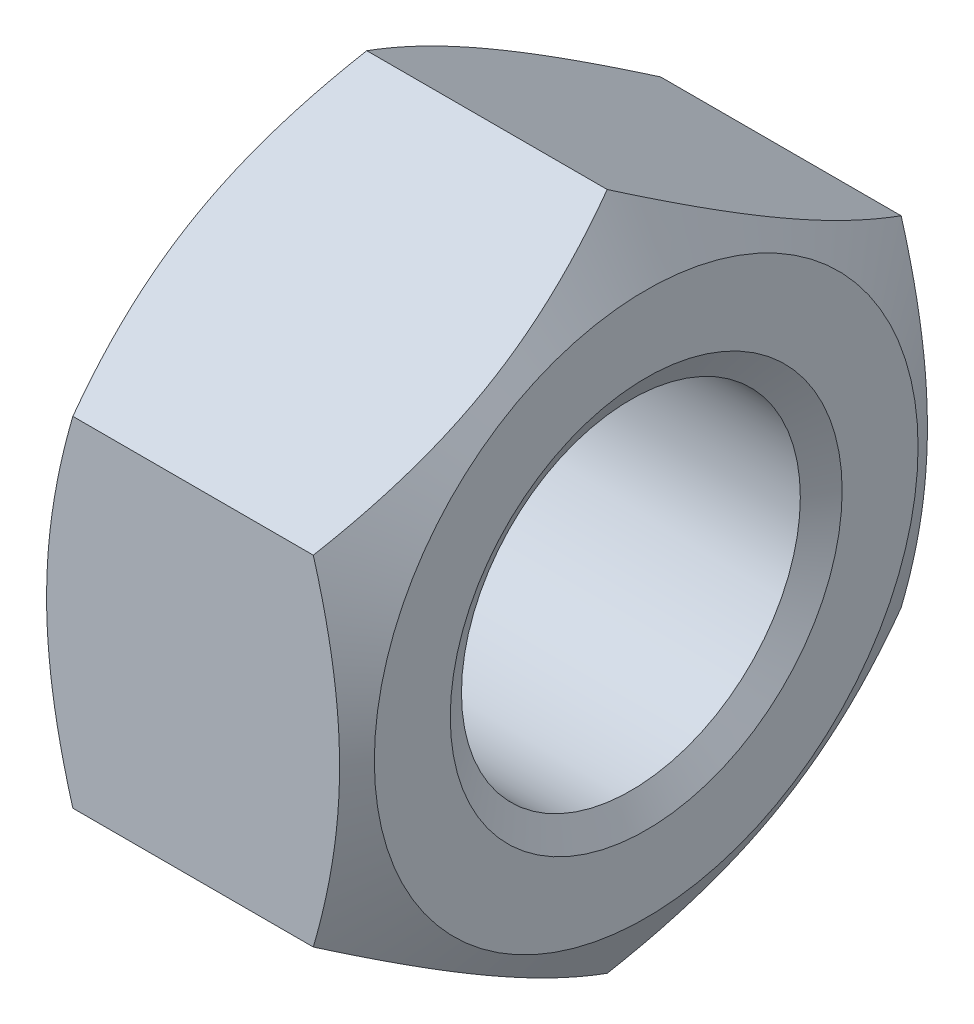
ISO-10303-21;
HEADER;
FILE_DESCRIPTION(('STEP AP214'),'2;1');
FILE_NAME('part.step','',(''),(''),'','','');
FILE_SCHEMA(('AUTOMOTIVE_DESIGN { 1 0 10303 214 1 1 1 1 }'));
ENDSEC;
DATA;
#1=APPLICATION_CONTEXT('core data for automotive mechanical design processes');
#2=APPLICATION_PROTOCOL_DEFINITION('international standard','automotive_design',2000,#1);
#3=PRODUCT_CONTEXT('',#1,'mechanical');
#4=PRODUCT('Part','Part','',(#3));
#5=PRODUCT_RELATED_PRODUCT_CATEGORY('part','',(#4));
#6=PRODUCT_DEFINITION_FORMATION('','',#4);
#7=PRODUCT_DEFINITION_CONTEXT('part definition',#1,'design');
#8=PRODUCT_DEFINITION('design','',#6,#7);
#9=PRODUCT_DEFINITION_SHAPE('','',#8);
#10=(LENGTH_UNIT() NAMED_UNIT(*) SI_UNIT(.MILLI.,.METRE.));
#11=(NAMED_UNIT(*) PLANE_ANGLE_UNIT() SI_UNIT($,.RADIAN.));
#12=(NAMED_UNIT(*) SI_UNIT($,.STERADIAN.) SOLID_ANGLE_UNIT());
#13=UNCERTAINTY_MEASURE_WITH_UNIT(LENGTH_MEASURE(1.E-05),#10,'distance_accuracy_value','');
#14=(GEOMETRIC_REPRESENTATION_CONTEXT(3) GLOBAL_UNCERTAINTY_ASSIGNED_CONTEXT((#13)) GLOBAL_UNIT_ASSIGNED_CONTEXT((#10,
#11,#12)) REPRESENTATION_CONTEXT('',''));
#15=CARTESIAN_POINT('',(0.,0.,0.));
#16=DIRECTION('',(0.,0.,1.));
#17=DIRECTION('',(1.,0.,0.));
#18=AXIS2_PLACEMENT_3D('',#15,#16,#17);
#19=CARTESIAN_POINT('',(0.,-6.92820323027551,12.));
#20=DIRECTION('',(0.,0.,1.));
#21=DIRECTION('',(1.,0.,0.));
#22=AXIS2_PLACEMENT_3D('',#19,#20,#21);
#23=PLANE('',#22);
#24=CARTESIAN_POINT('',(11.4085879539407,6.92820325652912,11.9999999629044));
#25=CARTESIAN_POINT('',(11.496499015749,6.62361160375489,11.9999999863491));
#26=CARTESIAN_POINT('',(11.580419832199,6.31788427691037,11.9999999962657));
#27=CARTESIAN_POINT('',(11.7391738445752,5.70397794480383,12.0000000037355));
#28=CARTESIAN_POINT('',(11.8140040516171,5.39579816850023,12.0000000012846));
#29=CARTESIAN_POINT('',(12.0234105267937,4.4662933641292,11.9999999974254));
#30=CARTESIAN_POINT('',(12.1425185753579,3.8412990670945,11.9999999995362));
#31=CARTESIAN_POINT('',(12.2821814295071,2.90602380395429,12.0000000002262));
#32=CARTESIAN_POINT('',(12.3219656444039,2.59853682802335,12.0000000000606));
#33=CARTESIAN_POINT('',(12.3886800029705,1.98213930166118,11.9999999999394));
#34=CARTESIAN_POINT('',(12.4156098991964,1.67322872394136,11.9999999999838));
#35=CARTESIAN_POINT('',(12.4559258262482,1.05489265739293,12.0000000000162));
#36=CARTESIAN_POINT('',(12.4693279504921,0.745468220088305,12.0000000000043));
#37=CARTESIAN_POINT('',(12.4823027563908,0.126332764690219,11.9999999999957));
#38=CARTESIAN_POINT('',(12.4818758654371,-0.183378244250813,11.9999999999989));
#39=CARTESIAN_POINT('',(12.4681585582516,-0.762368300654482,12.0000000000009));
#40=CARTESIAN_POINT('',(12.4565413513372,-1.03168866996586,12.0000000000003));
#41=CARTESIAN_POINT('',(12.423068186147,-1.56970995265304,11.9999999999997));
#42=CARTESIAN_POINT('',(12.4012115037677,-1.838410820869,11.9999999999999));
#43=CARTESIAN_POINT('',(12.3476403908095,-2.37504708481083,12.0000000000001));
#44=CARTESIAN_POINT('',(12.3159178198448,-2.64298166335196,12.));
#45=CARTESIAN_POINT('',(12.2431714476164,-3.17759475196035,12.));
#46=CARTESIAN_POINT('',(12.202147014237,-3.44427317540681,12.));
#47=CARTESIAN_POINT('',(12.0640839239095,-4.25378962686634,12.));
#48=CARTESIAN_POINT('',(11.9532796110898,-4.79428356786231,12.));
#49=CARTESIAN_POINT('',(11.7017999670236,-5.8672125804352,12.));
#50=CARTESIAN_POINT('',(11.5611836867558,-6.39966138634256,12.));
#51=CARTESIAN_POINT('',(11.4085880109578,-6.92820314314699,12.));
#52=B_SPLINE_CURVE_WITH_KNOTS('',3,(#24,#25,#26,#27,#28,#29,#30,#31,#32,#33,#34,#35,#36,#37,#38,
#39,#40,#41,#42,#43,#44,#45,#46,#47,#48,#49,#50,#51),.UNSPECIFIED.,.F.,.F.,(4,2,2,2,2,2,2,2,2,2,
2,2,2,4),(0.,0.950996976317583,1.90230578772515,3.80897262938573,4.73890633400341,
5.66885793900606,6.59770191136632,7.52651717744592,8.33503485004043,9.14360970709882,
9.95285350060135,10.7621523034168,12.4163368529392,14.0672749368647),.UNSPECIFIED.);
#53=CARTESIAN_POINT('',(11.4085879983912,6.92820325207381,11.9999999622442));
#54=VERTEX_POINT('',#53);
#55=CARTESIAN_POINT('',(11.4085879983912,-6.92820318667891,12.));
#56=VERTEX_POINT('',#55);
#57=EDGE_CURVE('E91',#54,#56,#52,.T.);
#58=ORIENTED_EDGE('',*,*,#57,.F.);
#59=DIRECTION('',(1.,0.,0.));
#60=VECTOR('',#59,1.);
#61=CARTESIAN_POINT('',(0.,6.92820323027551,12.));
#62=LINE('',#61,#60);
#63=CARTESIAN_POINT('',(1.59141200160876,6.92820318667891,12.));
#64=VERTEX_POINT('',#63);
#65=EDGE_CURVE('E79',#64,#54,#62,.T.);
#66=ORIENTED_EDGE('',*,*,#65,.F.);
#67=CARTESIAN_POINT('',(1.59141198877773,-6.92820314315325,12.0000000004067));
#68=CARTESIAN_POINT('',(1.50350094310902,-6.62361148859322,12.0000000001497));
#69=CARTESIAN_POINT('',(1.41958013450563,-6.31788416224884,12.0000000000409));
#70=CARTESIAN_POINT('',(1.26082613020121,-5.70397783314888,11.999999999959));
#71=CARTESIAN_POINT('',(1.18599592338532,-5.39579805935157,11.9999999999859));
#72=CARTESIAN_POINT('',(0.976589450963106,-4.46629326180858,12.0000000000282));
#73=CARTESIAN_POINT('',(0.857481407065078,-3.84129896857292,12.0000000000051));
#74=CARTESIAN_POINT('',(0.717818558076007,-2.90602371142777,11.9999999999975));
#75=CARTESIAN_POINT('',(0.67803434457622,-2.59853673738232,11.9999999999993));
#76=CARTESIAN_POINT('',(0.611319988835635,-1.98213921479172,12.0000000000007));
#77=CARTESIAN_POINT('',(0.58439009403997,-1.67322863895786,12.0000000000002));
#78=CARTESIAN_POINT('',(0.544074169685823,-1.05489257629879,11.9999999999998));
#79=CARTESIAN_POINT('',(0.530672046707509,-0.745468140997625,12.));
#80=CARTESIAN_POINT('',(0.517697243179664,-0.126332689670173,12.));
#81=CARTESIAN_POINT('',(0.518124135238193,0.18337831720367,12.));
#82=CARTESIAN_POINT('',(0.531841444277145,0.762368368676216,12.));
#83=CARTESIAN_POINT('',(0.543458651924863,1.03168873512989,12.));
#84=CARTESIAN_POINT('',(0.576931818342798,1.56971001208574,12.));
#85=CARTESIAN_POINT('',(0.598788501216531,1.83841087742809,12.));
#86=CARTESIAN_POINT('',(0.652359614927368,2.37504713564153,12.));
#87=CARTESIAN_POINT('',(0.684082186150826,2.64298171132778,12.));
#88=CARTESIAN_POINT('',(0.756828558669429,3.1775947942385,12.));
#89=CARTESIAN_POINT('',(0.797852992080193,3.44427321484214,12.));
#90=CARTESIAN_POINT('',(0.93591608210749,4.25378965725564,12.));
#91=CARTESIAN_POINT('',(1.04672039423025,4.79428359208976,12.));
#92=CARTESIAN_POINT('',(1.29820003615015,5.86721259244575,12.));
#93=CARTESIAN_POINT('',(1.43881631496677,6.39966139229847,12.));
#94=CARTESIAN_POINT('',(1.59141198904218,6.92820314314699,12.));
#95=B_SPLINE_CURVE_WITH_KNOTS('',3,(#67,#68,#69,#70,#71,#72,#73,#74,#75,#76,#77,#78,#79,#80,#81,
#82,#83,#84,#85,#86,#87,#88,#89,#90,#91,#92,#93,#94),.UNSPECIFIED.,.F.,.F.,(4,2,2,2,2,2,2,2,2,2,
2,2,2,4),(0.,0.950996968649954,1.90230577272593,3.80897260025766,4.73890629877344,
5.6688578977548,6.59770186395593,7.52651712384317,8.33503478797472,9.14360963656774,
9.95285342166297,10.7621522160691,12.4163367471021,14.0672748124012),.UNSPECIFIED.);
#96=CARTESIAN_POINT('',(1.5914120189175,-6.92820322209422,12.0000000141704));
#97=VERTEX_POINT('',#96);
#98=EDGE_CURVE('E115',#97,#64,#95,.T.);
#99=ORIENTED_EDGE('',*,*,#98,.F.);
#100=DIRECTION('',(1.,0.,0.));
#101=VECTOR('',#100,1.);
#102=CARTESIAN_POINT('',(0.,-6.92820323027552,12.));
#103=LINE('',#102,#101);
#104=EDGE_CURVE('E94',#56,#97,#103,.F.);
#105=ORIENTED_EDGE('',*,*,#104,.F.);
#106=EDGE_LOOP('',(#58,#66,#99,#105));
#107=FACE_BOUND('',#106,.T.);
#108=ADVANCED_FACE('F15',(#107),#23,.T.);
#109=CARTESIAN_POINT('',(0.,6.92820323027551,12.));
#110=DIRECTION('',(0.,0.866025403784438,0.500000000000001));
#111=DIRECTION('',(0.,-0.500000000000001,0.866025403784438));
#112=AXIS2_PLACEMENT_3D('',#109,#110,#111);
#113=PLANE('',#112);
#114=CARTESIAN_POINT('',(11.4085880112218,13.8564064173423,7.56524396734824E-08));
#115=CARTESIAN_POINT('',(11.4964990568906,13.7041105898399,0.263784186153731));
#116=CARTESIAN_POINT('',(11.5804198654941,13.5512469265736,0.528551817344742));
#117=CARTESIAN_POINT('',(11.7391738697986,13.2442937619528,1.06021029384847));
#118=CARTESIAN_POINT('',(11.8140040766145,13.0902038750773,1.32710180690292));
#119=CARTESIAN_POINT('',(12.0234105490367,12.6254514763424,2.13207657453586));
#120=CARTESIAN_POINT('',(12.1425185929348,12.3129543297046,2.6733375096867));
#121=CARTESIAN_POINT('',(12.2821814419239,11.8453167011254,3.48330964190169));
#122=CARTESIAN_POINT('',(12.3219656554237,11.6915732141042,3.74960117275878));
#123=CARTESIAN_POINT('',(12.3886800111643,11.3833744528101,4.28341708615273));
#124=CARTESIAN_POINT('',(12.41560990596,11.2289191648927,4.5509414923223));
#125=CARTESIAN_POINT('',(12.4559258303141,10.9197511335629,5.08643623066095));
#126=CARTESIAN_POINT('',(12.4693279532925,10.7650389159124,5.3544056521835));
#127=CARTESIAN_POINT('',(12.4823027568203,10.4554711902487,5.89059268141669));
#128=CARTESIAN_POINT('',(12.4818758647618,10.3006156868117,6.15881028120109));
#129=CARTESIAN_POINT('',(12.4681585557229,10.0111206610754,6.66023037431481));
#130=CARTESIAN_POINT('',(12.4565413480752,9.8764604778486,6.89346865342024));
#131=CARTESIAN_POINT('',(12.4230681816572,9.60744983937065,7.3594087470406));
#132=CARTESIAN_POINT('',(12.4012114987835,9.47309940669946,7.59211052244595));
#133=CARTESIAN_POINT('',(12.3476403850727,9.20478127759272,8.05685115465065));
#134=CARTESIAN_POINT('',(12.3159178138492,9.07081398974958,8.28888930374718));
#135=CARTESIAN_POINT('',(12.2431714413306,8.8035074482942,8.75187781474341));
#136=CARTESIAN_POINT('',(12.2021470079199,8.67016823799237,8.98282810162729));
#137=CARTESIAN_POINT('',(12.0640839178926,8.26541001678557,9.68388990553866));
#138=CARTESIAN_POINT('',(11.9532796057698,7.99516304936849,10.1519713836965));
#139=CARTESIAN_POINT('',(11.7017999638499,7.45869854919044,11.0811551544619));
#140=CARTESIAN_POINT('',(11.5611836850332,7.19247414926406,11.5422693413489));
#141=CARTESIAN_POINT('',(11.4085880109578,6.92820327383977,11.9999999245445));
#142=B_SPLINE_CURVE_WITH_KNOTS('',3,(#114,#115,#116,#117,#118,#119,#120,#121,#122,#123,#124,
#125,#126,#127,#128,#129,#130,#131,#132,#133,#134,#135,#136,#137,#138,#139,#140,#141),
.UNSPECIFIED.,.F.,.F.,(4,2,2,2,2,2,2,2,2,2,2,2,2,4),(0.,0.950996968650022,1.90230577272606,
3.80897260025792,4.73890629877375,5.66885789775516,6.59770186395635,7.52651712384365,
8.33503478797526,9.14360963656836,9.95285342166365,10.7621522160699,12.416336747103,
14.0672748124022),.UNSPECIFIED.);
#143=CARTESIAN_POINT('',(11.4085879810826,13.8564064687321,1.4169979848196E-08));
#144=VERTEX_POINT('',#143);
#145=EDGE_CURVE('E19',#144,#54,#142,.T.);
#146=ORIENTED_EDGE('',*,*,#145,.F.);
#147=DIRECTION('',(1.,0.,0.));
#148=VECTOR('',#147,1.);
#149=CARTESIAN_POINT('',(0.,13.856406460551,0.));
#150=LINE('',#149,#148);
#151=CARTESIAN_POINT('',(1.59141200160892,13.856406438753,3.77553228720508E-08));
#152=VERTEX_POINT('',#151);
#153=EDGE_CURVE('E72',#152,#144,#150,.T.);
#154=ORIENTED_EDGE('',*,*,#153,.F.);
#155=CARTESIAN_POINT('',(1.59141204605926,6.92820318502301,12.0000000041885));
#156=CARTESIAN_POINT('',(1.50350098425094,7.08049903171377,11.7362159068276));
#157=CARTESIAN_POINT('',(1.41958016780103,7.23336270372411,11.4714482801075));
#158=CARTESIAN_POINT('',(1.26082615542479,7.54031587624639,10.939789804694));
#159=CARTESIAN_POINT('',(1.18599594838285,7.69440576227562,10.672898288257));
#160=CARTESIAN_POINT('',(0.976589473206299,8.15915816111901,9.86792351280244));
#161=CARTESIAN_POINT('',(0.857481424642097,8.47165531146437,9.3266625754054));
#162=CARTESIAN_POINT('',(0.717818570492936,8.93929294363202,8.51669043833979));
#163=CARTESIAN_POINT('',(0.67803435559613,9.09303643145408,8.25039890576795));
#164=CARTESIAN_POINT('',(0.611319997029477,9.40123519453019,7.71658298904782));
#165=CARTESIAN_POINT('',(0.584390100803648,9.55569048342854,7.44905858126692));
#166=CARTESIAN_POINT('',(0.544074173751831,9.86485851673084,6.91356383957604));
#167=CARTESIAN_POINT('',(0.530672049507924,10.0195707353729,6.64559441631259));
#168=CARTESIAN_POINT('',(0.517697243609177,10.3291384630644,6.10940738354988));
#169=CARTESIAN_POINT('',(0.51812413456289,10.4839939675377,5.84118978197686));
#170=CARTESIAN_POINT('',(0.531841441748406,10.7734889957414,5.33976968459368));
#171=CARTESIAN_POINT('',(0.543458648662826,10.9081491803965,5.10653140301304));
#172=CARTESIAN_POINT('',(0.57693181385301,11.1771598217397,4.64059130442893));
#173=CARTESIAN_POINT('',(0.59878849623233,11.3115102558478,4.40788952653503));
#174=CARTESIAN_POINT('',(0.652359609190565,11.5798283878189,3.94314888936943));
#175=CARTESIAN_POINT('',(0.68408218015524,11.7137956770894,3.71111073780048));
#176=CARTESIAN_POINT('',(0.756828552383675,11.9811022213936,3.24812222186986));
#177=CARTESIAN_POINT('',(0.797852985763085,12.1144414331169,3.01717193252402));
#178=CARTESIAN_POINT('',(0.93591607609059,12.5191996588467,2.31611012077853));
#179=CARTESIAN_POINT('',(1.04672038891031,12.7894466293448,1.84802863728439));
#180=CARTESIAN_POINT('',(1.29820003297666,13.3259111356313,0.918844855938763));
#181=CARTESIAN_POINT('',(1.43881631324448,13.592135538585,0.457730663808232));
#182=CARTESIAN_POINT('',(1.59141198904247,13.8564064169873,7.54546713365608E-08));
#183=B_SPLINE_CURVE_WITH_KNOTS('',3,(#155,#156,#157,#158,#159,#160,#161,#162,#163,#164,#165,
#166,#167,#168,#169,#170,#171,#172,#173,#174,#175,#176,#177,#178,#179,#180,#181,#182),
.UNSPECIFIED.,.F.,.F.,(4,2,2,2,2,2,2,2,2,2,2,2,2,4),(0.,0.950996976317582,1.90230578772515,
3.80897262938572,4.7389063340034,5.66885793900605,6.59770191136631,7.52651717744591,
8.33503485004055,9.14360970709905,9.95285350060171,10.7621523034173,12.4163368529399,
14.0672749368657),.UNSPECIFIED.);
#184=EDGE_CURVE('E82',#64,#152,#183,.T.);
#185=ORIENTED_EDGE('',*,*,#184,.F.);
#186=ORIENTED_EDGE('',*,*,#65,.T.);
#187=EDGE_LOOP('',(#146,#154,#185,#186));
#188=FACE_BOUND('',#187,.T.);
#189=ADVANCED_FACE('F81',(#188),#113,.T.);
#190=CARTESIAN_POINT('',(0.,13.856406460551,0.));
#191=DIRECTION('',(0.,0.866025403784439,-0.499999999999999));
#192=DIRECTION('',(0.,0.499999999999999,0.866025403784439));
#193=AXIS2_PLACEMENT_3D('',#190,#191,#192);
#194=PLANE('',#193);
#195=CARTESIAN_POINT('',(11.4085879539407,6.92820318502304,-12.0000000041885));
#196=CARTESIAN_POINT('',(11.4964990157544,7.08049903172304,-11.7362159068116));
#197=CARTESIAN_POINT('',(11.5804198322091,7.23336270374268,-11.4714482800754));
#198=CARTESIAN_POINT('',(11.7391738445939,7.54031587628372,-10.9397898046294));
#199=CARTESIAN_POINT('',(11.8140040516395,7.69440576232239,-10.672898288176));
#200=CARTESIAN_POINT('',(12.0234105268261,8.15915816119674,-9.86792351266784));
#201=CARTESIAN_POINT('',(12.1425185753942,8.47165531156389,-9.32666257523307));
#202=CARTESIAN_POINT('',(12.2821814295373,8.93929294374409,-8.51669043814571));
#203=CARTESIAN_POINT('',(12.3219656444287,9.09303643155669,-8.25039890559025));
#204=CARTESIAN_POINT('',(12.388680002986,9.40123519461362,-7.71658298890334));
#205=CARTESIAN_POINT('',(12.4156098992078,9.55569048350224,-7.44905858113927));
#206=CARTESIAN_POINT('',(12.4559258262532,9.86485851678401,-6.91356383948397));
#207=CARTESIAN_POINT('',(12.4693279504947,10.0195707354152,-6.64559441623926));
#208=CARTESIAN_POINT('',(12.4823027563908,10.3291384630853,-6.10940738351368));
#209=CARTESIAN_POINT('',(12.4818758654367,10.483993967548,-5.84118978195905));
#210=CARTESIAN_POINT('',(12.4681585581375,10.7734889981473,-5.33976968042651));
#211=CARTESIAN_POINT('',(12.4565413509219,10.9081491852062,-5.10653139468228));
#212=CARTESIAN_POINT('',(12.4230681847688,11.1771598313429,-4.64059128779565));
#213=CARTESIAN_POINT('',(12.4012115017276,11.3115102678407,-4.40788950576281));
#214=CARTESIAN_POINT('',(12.3476403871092,11.5798284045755,-3.94314886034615));
#215=CARTESIAN_POINT('',(12.3159178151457,11.7137956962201,-3.71111070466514));
#216=CARTESIAN_POINT('',(12.2431714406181,11.9811022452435,-3.24812218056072));
#217=CARTESIAN_POINT('',(12.2021470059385,12.1144414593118,-3.01717188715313));
#218=CARTESIAN_POINT('',(12.0640839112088,12.5191996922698,-2.31611006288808));
#219=CARTESIAN_POINT('',(11.9532795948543,12.789446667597,-1.84802857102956));
#220=CARTESIAN_POINT('',(11.7017999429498,13.3259111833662,-0.918844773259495));
#221=CARTESIAN_POINT('',(11.5611836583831,13.592135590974,-0.457730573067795));
#222=CARTESIAN_POINT('',(11.4085879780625,13.8564064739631,2.323042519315E-08));
#223=B_SPLINE_CURVE_WITH_KNOTS('',3,(#195,#196,#197,#198,#199,#200,#201,#202,#203,#204,#205,
#206,#207,#208,#209,#210,#211,#212,#213,#214,#215,#216,#217,#218,#219,#220,#221,#222),
.UNSPECIFIED.,.F.,.F.,(4,2,2,2,2,2,2,2,2,2,2,2,2,4),(0.,0.950996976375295,1.90230578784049,
3.80897262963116,4.7389063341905,5.66885793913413,6.59770191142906,7.52651717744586,
8.33503486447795,9.14360973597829,9.95285354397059,10.7621523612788,12.4163369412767,
14.0672750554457),.UNSPECIFIED.);
#224=CARTESIAN_POINT('',(11.4085879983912,6.92820318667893,-12.));
#225=VERTEX_POINT('',#224);
#226=EDGE_CURVE('E93',#225,#144,#223,.T.);
#227=ORIENTED_EDGE('',*,*,#226,.F.);
#228=DIRECTION('',(-1.,0.,0.));
#229=VECTOR('',#228,1.);
#230=CARTESIAN_POINT('',(0.,6.92820323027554,-12.));
#231=LINE('',#230,#229);
#232=CARTESIAN_POINT('',(1.59141200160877,6.92820325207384,-11.9999999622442));
#233=VERTEX_POINT('',#232);
#234=EDGE_CURVE('E188',#233,#225,#231,.F.);
#235=ORIENTED_EDGE('',*,*,#234,.F.);
#236=CARTESIAN_POINT('',(1.59141204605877,13.8564064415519,4.12830518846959E-08));
#237=CARTESIAN_POINT('',(1.50350098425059,13.7041106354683,-0.263784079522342));
#238=CARTESIAN_POINT('',(1.41958016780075,13.551246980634,-0.528551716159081));
#239=CARTESIAN_POINT('',(1.26082615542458,13.2442938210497,-1.06021019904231));
#240=CARTESIAN_POINT('',(1.18599594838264,13.0902039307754,-1.32710171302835));
#241=CARTESIAN_POINT('',(0.976589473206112,12.6254515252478,-2.13207648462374));
#242=CARTESIAN_POINT('',(0.857481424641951,12.3129543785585,-2.67333742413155));
#243=CARTESIAN_POINT('',(0.717818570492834,11.8453167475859,-3.48330956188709));
#244=CARTESIAN_POINT('',(0.67803435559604,11.691573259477,-3.74960109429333));
#245=CARTESIAN_POINT('',(0.61131999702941,11.383374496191,-4.28341701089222));
#246=CARTESIAN_POINT('',(0.584390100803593,11.2289192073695,-4.55094141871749));
#247=CARTESIAN_POINT('',(0.544074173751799,10.9197511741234,-5.08643616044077));
#248=CARTESIAN_POINT('',(0.530672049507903,10.7650389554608,-5.35440558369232));
#249=CARTESIAN_POINT('',(0.517697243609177,10.4554712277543,-5.89059261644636));
#250=CARTESIAN_POINT('',(0.518124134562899,10.3006157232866,-6.15881021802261));
#251=CARTESIAN_POINT('',(0.531841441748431,10.0111206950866,-6.66023031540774));
#252=CARTESIAN_POINT('',(0.543458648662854,9.87646051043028,-6.89346859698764));
#253=CARTESIAN_POINT('',(0.57693181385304,9.60744986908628,-7.35940869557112));
#254=CARTESIAN_POINT('',(0.598788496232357,9.47309943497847,-7.59211047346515));
#255=CARTESIAN_POINT('',(0.652359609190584,9.2047813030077,-8.05685111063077));
#256=CARTESIAN_POINT('',(0.684082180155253,9.07081401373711,-8.28888926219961));
#257=CARTESIAN_POINT('',(0.75682855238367,8.80350746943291,-8.75187777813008));
#258=CARTESIAN_POINT('',(0.797852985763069,8.6701682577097,-8.98282806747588));
#259=CARTESIAN_POINT('',(0.935916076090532,8.26541003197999,-9.6838898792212));
#260=CARTESIAN_POINT('',(1.04672038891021,7.99516306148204,-10.1519713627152));
#261=CARTESIAN_POINT('',(1.29820003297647,7.45869855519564,-11.0811551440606));
#262=CARTESIAN_POINT('',(1.43881631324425,7.19247415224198,-11.542269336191));
#263=CARTESIAN_POINT('',(1.59141198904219,6.9282032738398,-11.9999999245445));
#264=B_SPLINE_CURVE_WITH_KNOTS('',3,(#236,#237,#238,#239,#240,#241,#242,#243,#244,#245,#246,
#247,#248,#249,#250,#251,#252,#253,#254,#255,#256,#257,#258,#259,#260,#261,#262,#263),
.UNSPECIFIED.,.F.,.F.,(4,2,2,2,2,2,2,2,2,2,2,2,2,4),(0.,0.950996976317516,1.90230578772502,
3.80897262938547,4.7389063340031,5.6688579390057,6.59770191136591,7.52651717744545,
8.33503485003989,9.14360970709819,9.95285350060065,10.762152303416,12.4163368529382,
14.0672749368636),.UNSPECIFIED.);
#265=EDGE_CURVE('E158',#152,#233,#264,.T.);
#266=ORIENTED_EDGE('',*,*,#265,.F.);
#267=ORIENTED_EDGE('',*,*,#153,.T.);
#268=EDGE_LOOP('',(#227,#235,#266,#267));
#269=FACE_BOUND('',#268,.T.);
#270=ADVANCED_FACE('F162',(#269),#194,.T.);
#271=CARTESIAN_POINT('',(0.,6.92820323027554,-12.));
#272=DIRECTION('',(0.,0.,-1.));
#273=DIRECTION('',(-1.,0.,0.));
#274=AXIS2_PLACEMENT_3D('',#271,#272,#273);
#275=PLANE('',#274);
#276=CARTESIAN_POINT('',(11.4085879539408,-6.92820325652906,-11.9999999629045));
#277=CARTESIAN_POINT('',(11.4964990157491,-6.62361160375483,-11.9999999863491));
#278=CARTESIAN_POINT('',(11.580419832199,-6.31788427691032,-11.9999999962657));
#279=CARTESIAN_POINT('',(11.7391738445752,-5.70397794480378,-12.0000000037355));
#280=CARTESIAN_POINT('',(11.8140040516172,-5.39579816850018,-12.0000000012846));
#281=CARTESIAN_POINT('',(12.0234105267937,-4.46629336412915,-11.9999999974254));
#282=CARTESIAN_POINT('',(12.1425185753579,-3.84129906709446,-11.9999999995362));
#283=CARTESIAN_POINT('',(12.2821814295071,-2.90602380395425,-12.0000000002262));
#284=CARTESIAN_POINT('',(12.3219656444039,-2.59853682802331,-12.0000000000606));
#285=CARTESIAN_POINT('',(12.3886800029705,-1.98213930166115,-11.9999999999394));
#286=CARTESIAN_POINT('',(12.4156098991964,-1.67322872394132,-11.9999999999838));
#287=CARTESIAN_POINT('',(12.4559258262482,-1.05489265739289,-12.0000000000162));
#288=CARTESIAN_POINT('',(12.4693279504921,-0.745468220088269,-12.0000000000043));
#289=CARTESIAN_POINT('',(12.4823027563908,-0.126332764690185,-11.9999999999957));
#290=CARTESIAN_POINT('',(12.4818758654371,0.183378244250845,-11.9999999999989));
#291=CARTESIAN_POINT('',(12.4681585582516,0.762368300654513,-12.0000000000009));
#292=CARTESIAN_POINT('',(12.4565413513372,1.03168866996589,-12.0000000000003));
#293=CARTESIAN_POINT('',(12.423068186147,1.56970995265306,-11.9999999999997));
#294=CARTESIAN_POINT('',(12.4012115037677,1.83841082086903,-11.9999999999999));
#295=CARTESIAN_POINT('',(12.3476403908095,2.37504708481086,-12.0000000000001));
#296=CARTESIAN_POINT('',(12.3159178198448,2.64298166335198,-12.));
#297=CARTESIAN_POINT('',(12.2431714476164,3.17759475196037,-12.));
#298=CARTESIAN_POINT('',(12.202147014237,3.44427317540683,-12.));
#299=CARTESIAN_POINT('',(12.0640839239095,4.25378962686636,-12.));
#300=CARTESIAN_POINT('',(11.9532796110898,4.79428356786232,-12.));
#301=CARTESIAN_POINT('',(11.7017999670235,5.86721258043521,-12.));
#302=CARTESIAN_POINT('',(11.5611836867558,6.39966138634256,-12.));
#303=CARTESIAN_POINT('',(11.4085880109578,6.928203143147,-12.));
#304=B_SPLINE_CURVE_WITH_KNOTS('',3,(#276,#277,#278,#279,#280,#281,#282,#283,#284,#285,#286,
#287,#288,#289,#290,#291,#292,#293,#294,#295,#296,#297,#298,#299,#300,#301,#302,#303),
.UNSPECIFIED.,.F.,.F.,(4,2,2,2,2,2,2,2,2,2,2,2,2,4),(0.,0.950996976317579,1.90230578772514,
3.80897262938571,4.73890633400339,5.66885793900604,6.5977019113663,7.52651717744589,
8.3350348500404,9.14360970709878,9.95285350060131,10.7621523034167,12.4163368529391,
14.0672749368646),.UNSPECIFIED.);
#305=CARTESIAN_POINT('',(11.4085879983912,-6.92820325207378,-11.9999999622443));
#306=VERTEX_POINT('',#305);
#307=EDGE_CURVE('E173',#306,#225,#304,.T.);
#308=ORIENTED_EDGE('',*,*,#307,.F.);
#309=DIRECTION('',(1.,0.,0.));
#310=VECTOR('',#309,1.);
#311=CARTESIAN_POINT('',(0.,-6.92820323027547,-12.));
#312=LINE('',#311,#310);
#313=CARTESIAN_POINT('',(1.59141200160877,-6.92820318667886,-12.));
#314=VERTEX_POINT('',#313);
#315=EDGE_CURVE('E186',#314,#306,#312,.T.);
#316=ORIENTED_EDGE('',*,*,#315,.F.);
#317=CARTESIAN_POINT('',(1.59141204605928,6.92820325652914,-11.9999999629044));
#318=CARTESIAN_POINT('',(1.50350098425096,6.62361160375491,-11.9999999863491));
#319=CARTESIAN_POINT('',(1.41958016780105,6.3178842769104,-11.9999999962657));
#320=CARTESIAN_POINT('',(1.2608261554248,5.70397794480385,-12.0000000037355));
#321=CARTESIAN_POINT('',(1.18599594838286,5.39579816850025,-12.0000000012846));
#322=CARTESIAN_POINT('',(0.976589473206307,4.46629336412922,-11.9999999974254));
#323=CARTESIAN_POINT('',(0.857481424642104,3.84129906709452,-11.9999999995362));
#324=CARTESIAN_POINT('',(0.717818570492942,2.90602380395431,-12.0000000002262));
#325=CARTESIAN_POINT('',(0.678034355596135,2.59853682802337,-12.0000000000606));
#326=CARTESIAN_POINT('',(0.611319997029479,1.9821393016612,-11.9999999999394));
#327=CARTESIAN_POINT('',(0.584390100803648,1.67322872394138,-11.9999999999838));
#328=CARTESIAN_POINT('',(0.54407417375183,1.05489265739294,-12.0000000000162));
#329=CARTESIAN_POINT('',(0.530672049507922,0.745468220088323,-12.0000000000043));
#330=CARTESIAN_POINT('',(0.517697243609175,0.126332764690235,-11.9999999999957));
#331=CARTESIAN_POINT('',(0.518124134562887,-0.183378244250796,-11.9999999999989));
#332=CARTESIAN_POINT('',(0.531841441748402,-0.762368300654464,-12.0000000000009));
#333=CARTESIAN_POINT('',(0.543458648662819,-1.03168866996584,-12.0000000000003));
#334=CARTESIAN_POINT('',(0.576931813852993,-1.56970995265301,-11.9999999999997));
#335=CARTESIAN_POINT('',(0.598788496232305,-1.83841082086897,-11.9999999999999));
#336=CARTESIAN_POINT('',(0.652359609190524,-2.37504708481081,-12.0000000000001));
#337=CARTESIAN_POINT('',(0.684082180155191,-2.64298166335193,-12.));
#338=CARTESIAN_POINT('',(0.756828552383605,-3.17759475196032,-12.));
#339=CARTESIAN_POINT('',(0.797852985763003,-3.44427317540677,-12.));
#340=CARTESIAN_POINT('',(0.935916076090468,-4.2537896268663,-12.));
#341=CARTESIAN_POINT('',(1.04672038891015,-4.79428356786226,-12.));
#342=CARTESIAN_POINT('',(1.29820003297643,-5.86721258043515,-12.));
#343=CARTESIAN_POINT('',(1.43881631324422,-6.3996613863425,-12.));
#344=CARTESIAN_POINT('',(1.59141198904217,-6.92820314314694,-12.));
#345=B_SPLINE_CURVE_WITH_KNOTS('',3,(#317,#318,#319,#320,#321,#322,#323,#324,#325,#326,#327,
#328,#329,#330,#331,#332,#333,#334,#335,#336,#337,#338,#339,#340,#341,#342,#343,#344),
.UNSPECIFIED.,.F.,.F.,(4,2,2,2,2,2,2,2,2,2,2,2,2,4),(0.,0.950996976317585,1.90230578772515,
3.80897262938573,4.73890633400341,5.66885793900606,6.59770191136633,7.52651717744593,
8.33503485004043,9.14360970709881,9.95285350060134,10.7621523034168,12.4163368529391,
14.0672749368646),.UNSPECIFIED.);
#346=EDGE_CURVE('E153',#233,#314,#345,.T.);
#347=ORIENTED_EDGE('',*,*,#346,.F.);
#348=ORIENTED_EDGE('',*,*,#234,.T.);
#349=EDGE_LOOP('',(#308,#316,#347,#348));
#350=FACE_BOUND('',#349,.T.);
#351=ADVANCED_FACE('F165',(#350),#275,.T.);
#352=CARTESIAN_POINT('',(0.,-6.92820323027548,-12.));
#353=DIRECTION('',(0.,-0.866025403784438,-0.500000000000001));
#354=DIRECTION('',(0.,0.500000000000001,-0.866025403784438));
#355=AXIS2_PLACEMENT_3D('',#352,#353,#354);
#356=PLANE('',#355);
#357=CARTESIAN_POINT('',(11.4085879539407,-13.8564064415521,4.12840602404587E-08));
#358=CARTESIAN_POINT('',(11.496499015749,-13.7041106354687,-0.263784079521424));
#359=CARTESIAN_POINT('',(11.580419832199,-13.5512469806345,-0.528551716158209));
#360=CARTESIAN_POINT('',(11.7391738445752,-13.2442938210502,-1.06021019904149));
#361=CARTESIAN_POINT('',(11.8140040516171,-13.0902039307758,-1.32710171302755));
#362=CARTESIAN_POINT('',(12.0234105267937,-12.6254515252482,-2.13207648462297));
#363=CARTESIAN_POINT('',(12.1425185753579,-12.3129543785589,-2.67333742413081));
#364=CARTESIAN_POINT('',(12.2821814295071,-11.8453167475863,-3.4833095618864));
#365=CARTESIAN_POINT('',(12.3219656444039,-11.6915732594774,-3.74960109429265));
#366=CARTESIAN_POINT('',(12.3886800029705,-11.3833744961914,-4.28341701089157));
#367=CARTESIAN_POINT('',(12.4156098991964,-11.2289192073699,-4.55094141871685));
#368=CARTESIAN_POINT('',(12.4559258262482,-10.9197511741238,-5.08643616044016));
#369=CARTESIAN_POINT('',(12.4693279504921,-10.7650389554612,-5.35440558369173));
#370=CARTESIAN_POINT('',(12.4823027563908,-10.4554712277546,-5.89059261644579));
#371=CARTESIAN_POINT('',(12.4818758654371,-10.3006157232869,-6.15881021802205));
#372=CARTESIAN_POINT('',(12.4681585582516,-10.0111206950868,-6.66023031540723));
#373=CARTESIAN_POINT('',(12.4565413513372,-9.87646051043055,-6.89346859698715));
#374=CARTESIAN_POINT('',(12.423068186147,-9.60744986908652,-7.35940869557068));
#375=CARTESIAN_POINT('',(12.4012115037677,-9.4730994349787,-7.59211047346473));
#376=CARTESIAN_POINT('',(12.3476403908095,-9.20478130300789,-8.0568511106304));
#377=CARTESIAN_POINT('',(12.3159178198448,-9.07081401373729,-8.28888926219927));
#378=CARTESIAN_POINT('',(12.2431714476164,-8.80350746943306,-8.75187777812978));
#379=CARTESIAN_POINT('',(12.202147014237,-8.67016825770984,-8.98282806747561));
#380=CARTESIAN_POINT('',(12.0640839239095,-8.26541003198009,-9.68388987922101));
#381=CARTESIAN_POINT('',(11.9532796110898,-7.9951630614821,-10.1519713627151));
#382=CARTESIAN_POINT('',(11.7017999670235,-7.45869855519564,-11.0811551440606));
#383=CARTESIAN_POINT('',(11.5611836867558,-7.19247415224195,-11.542269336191));
#384=CARTESIAN_POINT('',(11.4085880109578,-6.92820327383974,-11.9999999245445));
#385=B_SPLINE_CURVE_WITH_KNOTS('',3,(#357,#358,#359,#360,#361,#362,#363,#364,#365,#366,#367,
#368,#369,#370,#371,#372,#373,#374,#375,#376,#377,#378,#379,#380,#381,#382,#383,#384),
.UNSPECIFIED.,.F.,.F.,(4,2,2,2,2,2,2,2,2,2,2,2,2,4),(0.,0.950996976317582,1.90230578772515,
3.80897262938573,4.73890633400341,5.66885793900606,6.59770191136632,7.52651717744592,
8.33503485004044,9.14360970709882,9.95285350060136,10.7621523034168,12.4163368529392,
14.0672749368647),.UNSPECIFIED.);
#386=CARTESIAN_POINT('',(11.4085879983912,-13.8564064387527,3.77557693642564E-08));
#387=VERTEX_POINT('',#386);
#388=EDGE_CURVE('E97',#387,#306,#385,.T.);
#389=ORIENTED_EDGE('',*,*,#388,.F.);
#390=DIRECTION('',(1.,0.,0.));
#391=VECTOR('',#390,1.);
#392=CARTESIAN_POINT('',(0.,-13.856406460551,0.));
#393=LINE('',#392,#391);
#394=CARTESIAN_POINT('',(1.59141200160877,-13.8564064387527,-3.77557756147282E-08));
#395=VERTEX_POINT('',#394);
#396=EDGE_CURVE('E190',#395,#387,#393,.T.);
#397=ORIENTED_EDGE('',*,*,#396,.F.);
#398=CARTESIAN_POINT('',(1.59141204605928,-6.92820318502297,-12.0000000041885));
#399=CARTESIAN_POINT('',(1.50350098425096,-7.08049903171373,-11.7362159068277));
#400=CARTESIAN_POINT('',(1.41958016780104,-7.23336270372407,-11.4714482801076));
#401=CARTESIAN_POINT('',(1.2608261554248,-7.54031587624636,-10.939789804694));
#402=CARTESIAN_POINT('',(1.18599594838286,-7.69440576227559,-10.6728982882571));
#403=CARTESIAN_POINT('',(0.976589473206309,-8.15915816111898,-9.86792351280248));
#404=CARTESIAN_POINT('',(0.857481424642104,-8.47165531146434,-9.32666257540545));
#405=CARTESIAN_POINT('',(0.717818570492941,-8.93929294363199,-8.51669043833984));
#406=CARTESIAN_POINT('',(0.678034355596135,-9.09303643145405,-8.25039890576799));
#407=CARTESIAN_POINT('',(0.611319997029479,-9.40123519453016,-7.71658298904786));
#408=CARTESIAN_POINT('',(0.584390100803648,-9.55569048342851,-7.44905858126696));
#409=CARTESIAN_POINT('',(0.54407417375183,-9.86485851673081,-6.91356383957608));
#410=CARTESIAN_POINT('',(0.530672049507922,-10.0195707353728,-6.64559441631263));
#411=CARTESIAN_POINT('',(0.517697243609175,-10.3291384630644,-6.10940738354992));
#412=CARTESIAN_POINT('',(0.518124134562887,-10.4839939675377,-5.8411897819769));
#413=CARTESIAN_POINT('',(0.531841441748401,-10.7734889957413,-5.33976968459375));
#414=CARTESIAN_POINT('',(0.543458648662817,-10.9081491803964,-5.10653140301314));
#415=CARTESIAN_POINT('',(0.576931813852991,-11.1771598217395,-4.6405913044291));
#416=CARTESIAN_POINT('',(0.598788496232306,-11.3115102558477,-4.40788952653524));
#417=CARTESIAN_POINT('',(0.652359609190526,-11.5798283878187,-3.94314888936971));
#418=CARTESIAN_POINT('',(0.684082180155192,-11.7137956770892,-3.71111073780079));
#419=CARTESIAN_POINT('',(0.756828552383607,-11.9811022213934,-3.24812222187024));
#420=CARTESIAN_POINT('',(0.797852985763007,-12.1144414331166,-3.01717193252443));
#421=CARTESIAN_POINT('',(0.935916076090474,-12.5191996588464,-2.31611012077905));
#422=CARTESIAN_POINT('',(1.04672038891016,-12.7894466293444,-1.84802863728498));
#423=CARTESIAN_POINT('',(1.29820003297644,-13.3259111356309,-0.918844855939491));
#424=CARTESIAN_POINT('',(1.43881631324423,-13.5921355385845,-0.457730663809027));
#425=CARTESIAN_POINT('',(1.59141198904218,-13.8564064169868,-7.54555336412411E-08));
#426=B_SPLINE_CURVE_WITH_KNOTS('',3,(#398,#399,#400,#401,#402,#403,#404,#405,#406,#407,#408,
#409,#410,#411,#412,#413,#414,#415,#416,#417,#418,#419,#420,#421,#422,#423,#424,#425),
.UNSPECIFIED.,.F.,.F.,(4,2,2,2,2,2,2,2,2,2,2,2,2,4),(0.,0.950996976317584,1.90230578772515,
3.80897262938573,4.73890633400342,5.66885793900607,6.59770191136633,7.52651717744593,
8.33503485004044,9.14360970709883,9.95285350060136,10.7621523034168,12.4163368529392,
14.0672749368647),.UNSPECIFIED.);
#427=EDGE_CURVE('E39',#314,#395,#426,.T.);
#428=ORIENTED_EDGE('',*,*,#427,.F.);
#429=ORIENTED_EDGE('',*,*,#315,.T.);
#430=EDGE_LOOP('',(#389,#397,#428,#429));
#431=FACE_BOUND('',#430,.T.);
#432=ADVANCED_FACE('F169',(#431),#356,.T.);
#433=CARTESIAN_POINT('',(0.,-13.856406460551,0.));
#434=DIRECTION('',(0.,-0.866025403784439,0.5));
#435=DIRECTION('',(0.,-0.5,-0.866025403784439));
#436=AXIS2_PLACEMENT_3D('',#433,#434,#435);
#437=PLANE('',#436);
#438=CARTESIAN_POINT('',(11.4085879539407,-6.92820318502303,12.0000000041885));
#439=CARTESIAN_POINT('',(11.4964990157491,-7.08049903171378,11.7362159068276));
#440=CARTESIAN_POINT('',(11.580419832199,-7.23336270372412,11.4714482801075));
#441=CARTESIAN_POINT('',(11.7391738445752,-7.5403158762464,10.939789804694));
#442=CARTESIAN_POINT('',(11.8140040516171,-7.69440576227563,10.672898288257));
#443=CARTESIAN_POINT('',(12.0234105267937,-8.15915816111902,9.86792351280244));
#444=CARTESIAN_POINT('',(12.1425185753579,-8.47165531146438,9.3266625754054));
#445=CARTESIAN_POINT('',(12.2821814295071,-8.93929294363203,8.51669043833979));
#446=CARTESIAN_POINT('',(12.3219656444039,-9.09303643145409,8.25039890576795));
#447=CARTESIAN_POINT('',(12.3886800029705,-9.4012351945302,7.71658298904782));
#448=CARTESIAN_POINT('',(12.4156098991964,-9.55569048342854,7.44905858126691));
#449=CARTESIAN_POINT('',(12.4559258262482,-9.86485851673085,6.91356383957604));
#450=CARTESIAN_POINT('',(12.4693279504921,-10.0195707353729,6.64559441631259));
#451=CARTESIAN_POINT('',(12.4823027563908,-10.3291384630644,6.10940738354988));
#452=CARTESIAN_POINT('',(12.4818758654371,-10.4839939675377,5.84118978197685));
#453=CARTESIAN_POINT('',(12.4681585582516,-10.7734889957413,5.33976968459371));
#454=CARTESIAN_POINT('',(12.4565413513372,-10.9081491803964,5.1065314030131));
#455=CARTESIAN_POINT('',(12.423068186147,-11.1771598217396,4.64059130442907));
#456=CARTESIAN_POINT('',(12.4012115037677,-11.3115102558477,4.4078895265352));
#457=CARTESIAN_POINT('',(12.3476403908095,-11.5798283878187,3.94314888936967));
#458=CARTESIAN_POINT('',(12.3159178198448,-11.7137956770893,3.71111073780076));
#459=CARTESIAN_POINT('',(12.2431714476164,-11.9811022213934,3.24812222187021));
#460=CARTESIAN_POINT('',(12.202147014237,-12.1144414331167,3.0171719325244));
#461=CARTESIAN_POINT('',(12.0640839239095,-12.5191996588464,2.31611012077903));
#462=CARTESIAN_POINT('',(11.9532796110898,-12.7894466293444,1.84802863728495));
#463=CARTESIAN_POINT('',(11.7017999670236,-13.3259111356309,0.918844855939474));
#464=CARTESIAN_POINT('',(11.5611836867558,-13.5921355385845,0.457730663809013));
#465=CARTESIAN_POINT('',(11.4085880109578,-13.8564064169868,7.54555216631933E-08));
#466=B_SPLINE_CURVE_WITH_KNOTS('',3,(#438,#439,#440,#441,#442,#443,#444,#445,#446,#447,#448,
#449,#450,#451,#452,#453,#454,#455,#456,#457,#458,#459,#460,#461,#462,#463,#464,#465),
.UNSPECIFIED.,.F.,.F.,(4,2,2,2,2,2,2,2,2,2,2,2,2,4),(0.,0.950996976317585,1.90230578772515,
3.80897262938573,4.73890633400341,5.66885793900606,6.59770191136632,7.52651717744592,
8.33503485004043,9.14360970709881,9.95285350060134,10.7621523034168,12.4163368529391,
14.0672749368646),.UNSPECIFIED.);
#467=EDGE_CURVE('E96',#56,#387,#466,.T.);
#468=ORIENTED_EDGE('',*,*,#467,.F.);
#469=ORIENTED_EDGE('',*,*,#104,.T.);
#470=CARTESIAN_POINT('',(1.59141204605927,-13.8564064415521,-4.12840682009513E-08));
#471=CARTESIAN_POINT('',(1.50350098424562,-13.7041106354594,0.263784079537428));
#472=CARTESIAN_POINT('',(1.41958016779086,-13.5512469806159,0.528551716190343));
#473=CARTESIAN_POINT('',(1.26082615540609,-13.2442938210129,1.06021019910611));
#474=CARTESIAN_POINT('',(1.18599594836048,-13.0902039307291,1.32710171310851));
#475=CARTESIAN_POINT('',(0.976589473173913,-12.6254515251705,2.13207648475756));
#476=CARTESIAN_POINT('',(0.857481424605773,-12.3129543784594,2.67333742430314));
#477=CARTESIAN_POINT('',(0.717818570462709,-11.8453167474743,3.48330956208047));
#478=CARTESIAN_POINT('',(0.678034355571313,-11.6915732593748,3.74960109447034));
#479=CARTESIAN_POINT('',(0.611319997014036,-11.383374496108,4.28341701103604));
#480=CARTESIAN_POINT('',(0.584390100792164,-11.2289192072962,4.55094141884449));
#481=CARTESIAN_POINT('',(0.544074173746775,-10.9197511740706,5.08643616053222));
#482=CARTESIAN_POINT('',(0.530672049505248,-10.7650389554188,5.35440558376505));
#483=CARTESIAN_POINT('',(0.517697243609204,-10.4554712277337,5.89059261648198));
#484=CARTESIAN_POINT('',(0.518124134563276,-10.3006157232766,6.15881021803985));
#485=CARTESIAN_POINT('',(0.531841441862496,-10.0111206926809,6.66023031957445));
#486=CARTESIAN_POINT('',(0.543458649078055,-9.87646050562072,6.89346860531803));
#487=CARTESIAN_POINT('',(0.576931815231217,-9.60744985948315,7.35940871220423));
#488=CARTESIAN_POINT('',(0.598788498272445,-9.47309942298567,7.59211049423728));
#489=CARTESIAN_POINT('',(0.652359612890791,-9.20478128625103,8.05685113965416));
#490=CARTESIAN_POINT('',(0.684082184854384,-9.07081399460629,8.28888929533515));
#491=CARTESIAN_POINT('',(0.756828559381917,-8.80350744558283,8.75187781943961));
#492=CARTESIAN_POINT('',(0.797852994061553,-8.67016823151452,8.98282811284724));
#493=CARTESIAN_POINT('',(0.935916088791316,-8.26540999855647,9.68388993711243));
#494=CARTESIAN_POINT('',(1.04672040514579,-7.99516302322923,10.151971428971));
#495=CARTESIAN_POINT('',(1.29820005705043,-7.45869850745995,11.0811552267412));
#496=CARTESIAN_POINT('',(1.43881634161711,-7.19247409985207,11.542269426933));
#497=CARTESIAN_POINT('',(1.59141202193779,-6.92820321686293,12.0000000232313));
#498=B_SPLINE_CURVE_WITH_KNOTS('',3,(#470,#471,#472,#473,#474,#475,#476,#477,#478,#479,#480,
#481,#482,#483,#484,#485,#486,#487,#488,#489,#490,#491,#492,#493,#494,#495,#496,#497),
.UNSPECIFIED.,.F.,.F.,(4,2,2,2,2,2,2,2,2,2,2,2,2,4),(0.,0.950996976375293,1.90230578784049,
3.80897262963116,4.7389063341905,5.66885793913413,6.59770191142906,7.52651717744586,
8.33503486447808,9.14360973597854,9.95285354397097,10.7621523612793,12.4163369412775,
14.0672750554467),.UNSPECIFIED.);
#499=EDGE_CURVE('E141',#395,#97,#498,.T.);
#500=ORIENTED_EDGE('',*,*,#499,.F.);
#501=ORIENTED_EDGE('',*,*,#396,.T.);
#502=EDGE_LOOP('',(#468,#469,#500,#501));
#503=FACE_BOUND('',#502,.T.);
#504=ADVANCED_FACE('F209',(#503),#437,.T.);
#505=CARTESIAN_POINT('',(11.3990395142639,0.,0.));
#506=DIRECTION('',(-1.,0.,0.));
#507=DIRECTION('',(0.,0.,1.));
#508=AXIS2_PLACEMENT_3D('',#505,#506,#507);
#509=CONICAL_SURFACE('',#508,13.8729448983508,1.04719755);
#510=CARTESIAN_POINT('',(13.0000000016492,0.,0.));
#511=DIRECTION('',(-1.,0.,0.));
#512=DIRECTION('',(0.,0.,1.));
#513=AXIS2_PLACEMENT_3D('',#510,#511,#512);
#514=CIRCLE('',#513,11.1000000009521);
#515=CARTESIAN_POINT('',(13.0000000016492,0.,11.1000000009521));
#516=VERTEX_POINT('',#515);
#517=EDGE_CURVE('E203',#516,#516,#514,.F.);
#518=ORIENTED_EDGE('',*,*,#517,.F.);
#519=EDGE_LOOP('',(#518));
#520=FACE_BOUND('',#519,.T.);
#521=ORIENTED_EDGE('',*,*,#307,.T.);
#522=ORIENTED_EDGE('',*,*,#226,.T.);
#523=ORIENTED_EDGE('',*,*,#145,.T.);
#524=ORIENTED_EDGE('',*,*,#57,.T.);
#525=ORIENTED_EDGE('',*,*,#467,.T.);
#526=ORIENTED_EDGE('',*,*,#388,.T.);
#527=EDGE_LOOP('',(#521,#522,#523,#524,#525,#526));
#528=FACE_BOUND('',#527,.T.);
#529=ADVANCED_FACE('F89',(#520,#528),#509,.T.);
#530=CARTESIAN_POINT('',(1.60096048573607,0.,0.));
#531=DIRECTION('',(1.,0.,0.));
#532=DIRECTION('',(0.,0.,-1.));
#533=AXIS2_PLACEMENT_3D('',#530,#531,#532);
#534=CONICAL_SURFACE('',#533,13.8729448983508,1.04719755);
#535=CARTESIAN_POINT('',(-1.64915498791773E-09,0.,0.));
#536=DIRECTION('',(1.,0.,0.));
#537=DIRECTION('',(0.,0.,-1.));
#538=AXIS2_PLACEMENT_3D('',#535,#536,#537);
#539=CIRCLE('',#538,11.1000000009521);
#540=CARTESIAN_POINT('',(-1.64915490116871E-09,0.,-11.1000000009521));
#541=VERTEX_POINT('',#540);
#542=EDGE_CURVE('E201',#541,#541,#539,.T.);
#543=ORIENTED_EDGE('',*,*,#542,.T.);
#544=EDGE_LOOP('',(#543));
#545=FACE_BOUND('',#544,.T.);
#546=ORIENTED_EDGE('',*,*,#427,.T.);
#547=ORIENTED_EDGE('',*,*,#499,.T.);
#548=ORIENTED_EDGE('',*,*,#98,.T.);
#549=ORIENTED_EDGE('',*,*,#184,.T.);
#550=ORIENTED_EDGE('',*,*,#265,.T.);
#551=ORIENTED_EDGE('',*,*,#346,.T.);
#552=EDGE_LOOP('',(#546,#547,#548,#549,#550,#551));
#553=FACE_BOUND('',#552,.T.);
#554=ADVANCED_FACE('F129',(#545,#553),#534,.T.);
#555=CARTESIAN_POINT('',(13.,0.,0.));
#556=DIRECTION('',(1.,0.,0.));
#557=DIRECTION('',(0.,0.,-1.));
#558=AXIS2_PLACEMENT_3D('',#555,#556,#557);
#559=PLANE('',#558);
#560=CARTESIAN_POINT('',(13.0000000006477,0.,0.));
#561=DIRECTION('',(1.,0.,0.));
#562=DIRECTION('',(0.,0.,-1.));
#563=AXIS2_PLACEMENT_3D('',#560,#561,#562);
#564=CIRCLE('',#563,8.00003175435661);
#565=CARTESIAN_POINT('',(13.0000000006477,0.,-8.00003175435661));
#566=VERTEX_POINT('',#565);
#567=EDGE_CURVE('E198',#566,#566,#564,.F.);
#568=ORIENTED_EDGE('',*,*,#567,.T.);
#569=EDGE_LOOP('',(#568));
#570=FACE_BOUND('',#569,.T.);
#571=ORIENTED_EDGE('',*,*,#517,.T.);
#572=EDGE_LOOP('',(#571));
#573=FACE_BOUND('',#572,.T.);
#574=ADVANCED_FACE('F133',(#570,#573),#559,.T.);
#575=CARTESIAN_POINT('',(0.,0.,0.));
#576=DIRECTION('',(1.,0.,0.));
#577=DIRECTION('',(0.,0.,-1.));
#578=AXIS2_PLACEMENT_3D('',#575,#576,#577);
#579=PLANE('',#578);
#580=CARTESIAN_POINT('',(-6.47677386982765E-10,0.,0.));
#581=DIRECTION('',(-1.,0.,0.));
#582=DIRECTION('',(0.,0.,1.));
#583=AXIS2_PLACEMENT_3D('',#580,#581,#582);
#584=CIRCLE('',#583,8.00003175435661);
#585=CARTESIAN_POINT('',(-6.47677386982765E-10,0.,8.00003175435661));
#586=VERTEX_POINT('',#585);
#587=EDGE_CURVE('E195',#586,#586,#584,.F.);
#588=ORIENTED_EDGE('',*,*,#587,.T.);
#589=EDGE_LOOP('',(#588));
#590=FACE_BOUND('',#589,.T.);
#591=ORIENTED_EDGE('',*,*,#542,.F.);
#592=EDGE_LOOP('',(#591));
#593=FACE_BOUND('',#592,.T.);
#594=ADVANCED_FACE('F235',(#590,#593),#579,.F.);
#595=CARTESIAN_POINT('',(13.0000000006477,0.,0.));
#596=DIRECTION('',(1.,0.,0.));
#597=DIRECTION('',(0.,0.,-1.));
#598=AXIS2_PLACEMENT_3D('',#595,#596,#597);
#599=CONICAL_SURFACE('',#598,8.00003175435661,1.04719755);
#600=ORIENTED_EDGE('',*,*,#567,.F.);
#601=EDGE_LOOP('',(#600));
#602=FACE_BOUND('',#601,.T.);
#603=CARTESIAN_POINT('',(12.375,0.,0.));
#604=DIRECTION('',(-1.,0.,0.));
#605=DIRECTION('',(0.,0.,1.));
#606=AXIS2_PLACEMENT_3D('',#603,#604,#605);
#607=CIRCLE('',#606,6.9175);
#608=CARTESIAN_POINT('',(12.375,0.,6.9175));
#609=VERTEX_POINT('',#608);
#610=EDGE_CURVE('E30',#609,#609,#607,.T.);
#611=ORIENTED_EDGE('',*,*,#610,.T.);
#612=EDGE_LOOP('',(#611));
#613=FACE_BOUND('',#612,.T.);
#614=ADVANCED_FACE('F219',(#602,#613),#599,.F.);
#615=CARTESIAN_POINT('',(-6.47677386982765E-10,0.,0.));
#616=DIRECTION('',(-1.,0.,0.));
#617=DIRECTION('',(0.,0.,1.));
#618=AXIS2_PLACEMENT_3D('',#615,#616,#617);
#619=CONICAL_SURFACE('',#618,8.00003175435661,1.04719755);
#620=ORIENTED_EDGE('',*,*,#587,.F.);
#621=EDGE_LOOP('',(#620));
#622=FACE_BOUND('',#621,.T.);
#623=CARTESIAN_POINT('',(0.625,0.,0.));
#624=DIRECTION('',(1.,0.,0.));
#625=DIRECTION('',(0.,1.,0.));
#626=AXIS2_PLACEMENT_3D('',#623,#624,#625);
#627=CIRCLE('',#626,6.9175);
#628=CARTESIAN_POINT('',(0.625,6.9175,0.));
#629=VERTEX_POINT('',#628);
#630=EDGE_CURVE('E10',#629,#629,#627,.T.);
#631=ORIENTED_EDGE('',*,*,#630,.T.);
#632=EDGE_LOOP('',(#631));
#633=FACE_BOUND('',#632,.T.);
#634=ADVANCED_FACE('F222',(#622,#633),#619,.F.);
#635=CARTESIAN_POINT('',(12.375,0.,0.));
#636=DIRECTION('',(-1.,0.,0.));
#637=DIRECTION('',(0.,0.,1.));
#638=AXIS2_PLACEMENT_3D('',#635,#636,#637);
#639=CYLINDRICAL_SURFACE('',#638,6.9175);
#640=ORIENTED_EDGE('',*,*,#630,.F.);
#641=EDGE_LOOP('',(#640));
#642=FACE_BOUND('',#641,.T.);
#643=ORIENTED_EDGE('',*,*,#610,.F.);
#644=EDGE_LOOP('',(#643));
#645=FACE_BOUND('',#644,.T.);
#646=ADVANCED_FACE('F17',(#642,#645),#639,.F.);
#647=CLOSED_SHELL('',(#108,#189,#270,#351,#432,#504,#529,#554,#574,#594,#614,#634,#646));
#648=MANIFOLD_SOLID_BREP('B1',#647);
#649=ADVANCED_BREP_SHAPE_REPRESENTATION('',(#18,#648),#14);
#650=SHAPE_DEFINITION_REPRESENTATION(#9,#649);
ENDSEC;
END-ISO-10303-21;
